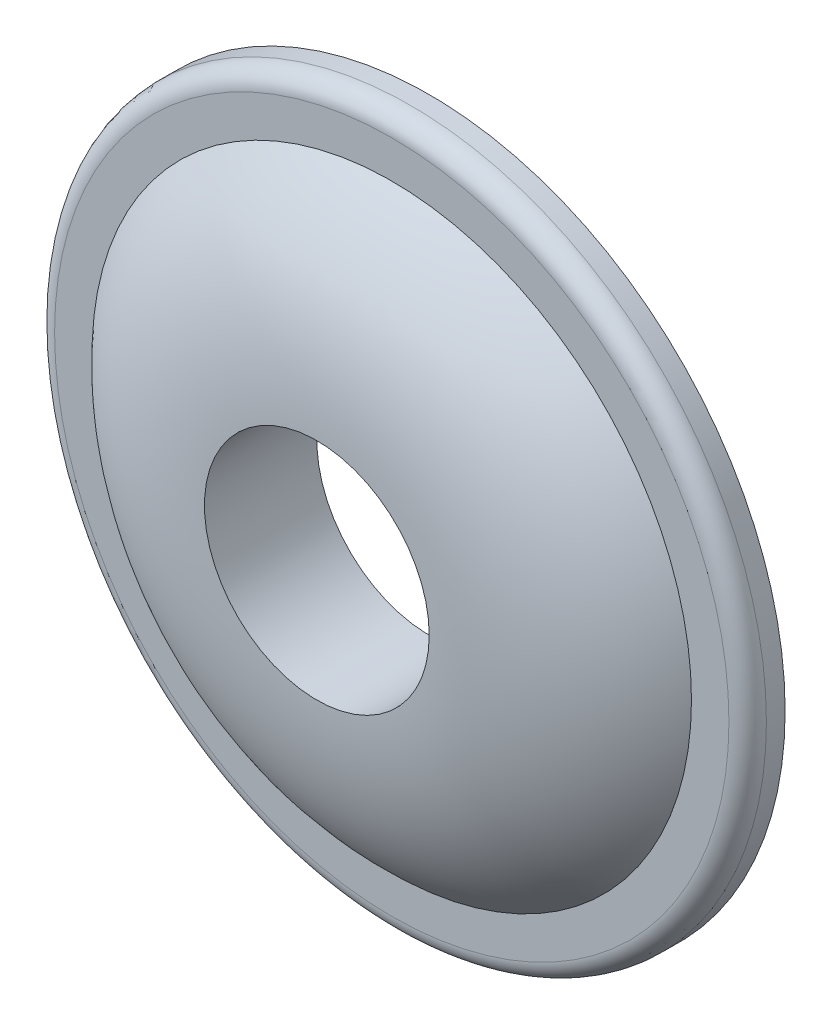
from build123d import *


with BuildPart() as part:
    # Sketch 1 → Revolve 1 (revolve)
    with BuildSketch(Plane(origin=(0, 0, 0), x_dir=(0, 0, -1), z_dir=(1, 0, 0)), mode=Mode.PRIVATE) as revolve_1_sk:
        with BuildLine():
            Line((0, 3), (3, 3))
            Line((3, 3), (3, 9.5))
            Line((3, 9.5), (2.5, 9.5))
            ThreePointArc((2.5, 9.5), (2.146446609, 9.353553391), (2, 9))
            Line((2, 9), (2, 8))
            add(Edge.make_bspline(
                [(0, 3), (0, 6.20034879), (2, 8)],
                knots=[0, 0, 0, 1, 1, 1], degree=2))
        make_face()
    revolve(revolve_1_sk.sketch.rotate(Axis((0, 0, 0), (0, 0, -1)), 90), axis=Axis((0, 0, 0), (0, 0, -1)))


solid = part.part
